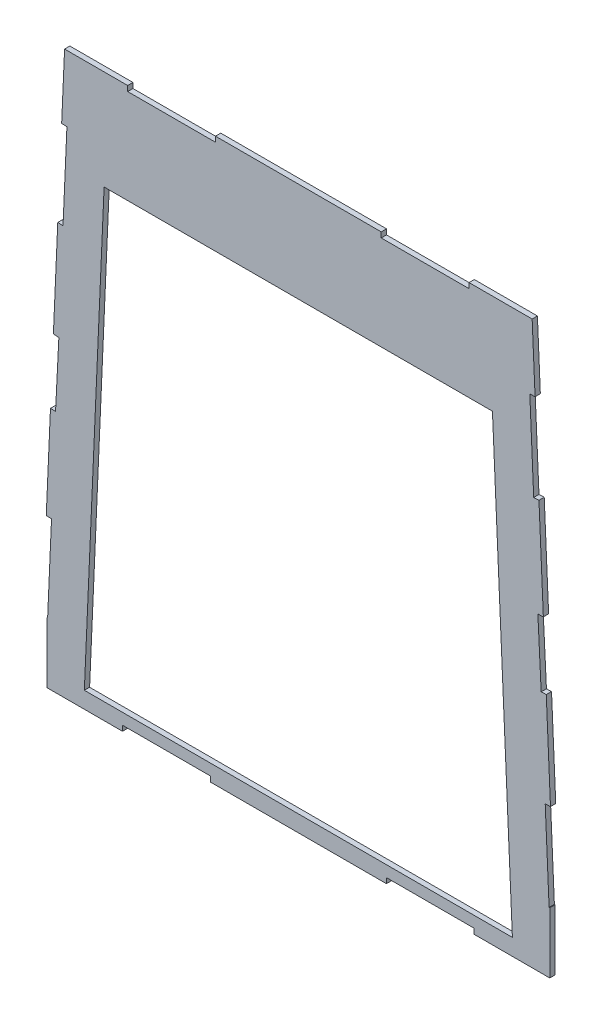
from build123d import *

# Parameters (mm, degrees)
BOSS_EXTRUDE1_DEPTH = 1.524
CUT_EXTRUDE4_DEPTH  = 130.88462944


with BuildPart() as part:
    # Sketch1 → Boss-Extrude1 (new body)
    with BuildSketch(Plane.XY):
        Polygon((70.409233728, 59.969831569), (69.283940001, 85.344892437), (70.806443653, 85.41241006), (69.961617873, 104.462996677), (51.710180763, 104.462996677), (51.710180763, 102.938996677), (26.310180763, 102.938996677), (26.310180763, 104.462996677), (-21.640930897, 104.462996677), (-21.640930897, 102.938996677), (-47.040930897, 102.938996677), (-47.040930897, 104.462996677), (-65.292368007, 104.462996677), (-66.137193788, 85.41241006), (-64.614690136, 85.344892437), (-65.739983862, 59.969831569), (-67.262487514, 60.037349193), (-68.530061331, 31.453911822), (-66.94880749, 31.384731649), (-67.902307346, 12.359457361), (-69.374029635, 12.422661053), (-70.592289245, -15.048754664), (-69.069785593, -15.116272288), (-70.19507932, -40.491333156), (-71.717582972, -40.423815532), (-72.500541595, -58.079314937), (-48.534531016, -58.079314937), (-48.534531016, -56.555314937), (-23.134531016, -56.555314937), (-23.134531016, -58.079314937), (27.803780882, -58.079314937), (27.803780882, -56.555314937), (53.203780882, -56.555314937), (53.203780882, -58.079314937), (77.169791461, -58.079314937), (76.386832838, -40.423815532), (74.864329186, -40.491333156), (73.739035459, -15.116272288), (75.261539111, -15.048754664), (74.043279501, 12.422661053), (72.571557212, 12.359457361), (71.618057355, 31.384731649), (73.199311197, 31.453911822), (71.93173738, 60.037349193), align=None)
        Polygon((64.246109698, -53.316814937), (58.47481532, 75.62077657), (-53.858936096, 75.62077657), (-59.576859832, -53.316814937), align=None, mode=Mode.SUBTRACT)
    extrude(amount=BOSS_EXTRUDE1_DEPTH)

    # Sketch3 → Cut-Extrude4 (cut, through all)
    with BuildSketch(Plane.XY.offset(1.524)):
        Polygon((-70.390739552, -40.48265632), (-70.390739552, -59.75491678), (-75.847098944, -59.75491678), (-74.852068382, -37.317254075), align=None)
        Polygon((79.521318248, -37.317254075), (75.059989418, -40.48265632), (75.059989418, -59.75491678), (80.51634881, -59.75491678), align=None)
    extrude(amount=-CUT_EXTRUDE4_DEPTH, mode=Mode.SUBTRACT)


solid = part.part
